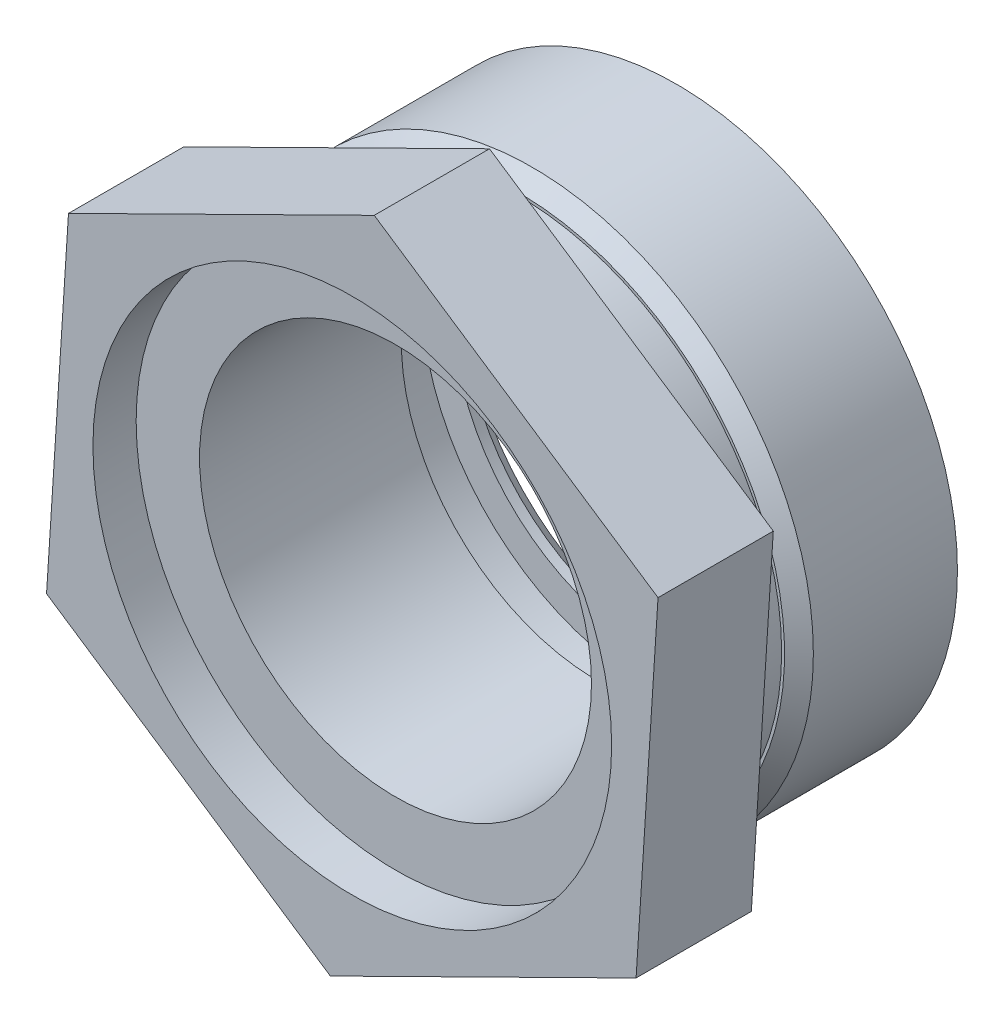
from build123d import *

# Parameters (mm, degrees)
BASE_EXTRUSION_DEPTH    = 8
ESQUISSE6_R             = 19.5
BOSS_EXTRU_2_DEPTH      = 11
CHANFREIN1_SIZE         = 1
ESQUISSE7_R             = 18
ENL_V_MAT_EXTRU_1_DEPTH = 3
ESQUISSE8_R             = 13.6
ENL_V_MAT_EXTRU_2_DEPTH = 38.262827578
CHANFREIN2_SIZE         = 1.2
ESQUISSE9_W             = 15.8
ESQUISSE9_H             = 3.6
CONG_2_R                = 0.2


with BuildPart() as part:
    # Esquisse3 → Base-Extrusion (new body)
    with BuildSketch(Plane.XY):
        Polygon((19.695762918, -13.130508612), (21.219235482, 10.491776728), (1.523472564, 23.62228534), (-19.695762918, 13.130508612), (-21.219235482, -10.491776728), (-1.523472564, -23.62228534), align=None)
    extrude(amount=BASE_EXTRUSION_DEPTH)

    # Esquisse5 → Boss.-R_vol.1 (revolve)
    with BuildSketch(Plane(origin=(0, 0, 0), x_dir=(1, 0, 0), z_dir=(0, 1, 0)), mode=Mode.PRIVATE) as boss_r_vol_1_sk:
        Polygon((0, 3.5), (0, 0), (-19.5, 0), (-18.3, 1.2), (-18.3, 3.5), align=None)
    revolve(boss_r_vol_1_sk.sketch.rotate(Axis((0, 0, -10), (0, 0, 1)), 180), axis=Axis((0, 0, -10), (0, 0, 1)))

    # Esquisse6 → Boss.-Extru.2 (add)
    with BuildSketch(Plane(origin=(0, 0, -3.5), x_dir=(-1, 0, 0), z_dir=(0, 0, -1))):
        with Locations(Location((0, 0, 0), (0, 0, 180))):
            Circle(ESQUISSE6_R)
    extrude(amount=BOSS_EXTRU_2_DEPTH)

    # Chanfrein1
    chanfrein1_edges = [part.edges().sort_by_distance(p)[0] for p in [
        (-19.5, 0, -3.5),
    ]]
    chamfer(chanfrein1_edges, length=CHANFREIN1_SIZE)

    # Esquisse7 → Enl_v. mat.-Extru.1 (cut)
    with BuildSketch(Plane.XY.offset(8)):
        Circle(ESQUISSE7_R)
    extrude(amount=-ENL_V_MAT_EXTRU_1_DEPTH, mode=Mode.SUBTRACT)

    # Esquisse8 → Enl_v. mat.-Extru.2 (cut, through all)
    with BuildSketch(Plane.XY.offset(5)):
        Circle(ESQUISSE8_R)
    extrude(amount=-ENL_V_MAT_EXTRU_2_DEPTH, mode=Mode.SUBTRACT)

    # Chanfrein2
    chanfrein2_edges = [part.edges().sort_by_distance(p)[0] for p in [
        (-13.6, 0, -14.5),
    ]]
    chamfer(chanfrein2_edges, length=CHANFREIN2_SIZE)

    # Esquisse9 → Enl_vement de mati_re-R_volution1 (revolve, cut)
    with BuildSketch(Plane(origin=(0, 0, 0), x_dir=(1, 0, 0), z_dir=(0, 1, 0))):
        with Locations((-7.9, 10.8)):
            Rectangle(ESQUISSE9_W, ESQUISSE9_H)
    revolve(axis=Axis((0, 0, -16.546940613), (0, 0, 1)), mode=Mode.SUBTRACT)

    # Cong_2
    cong_2_edges = [part.edges().sort_by_distance(p)[0] for p in [
        (-18.3, 0, -1.2),
        (-19.5, 0, 0),
    ]]
    fillet(cong_2_edges, radius=CONG_2_R)


solid = part.part
